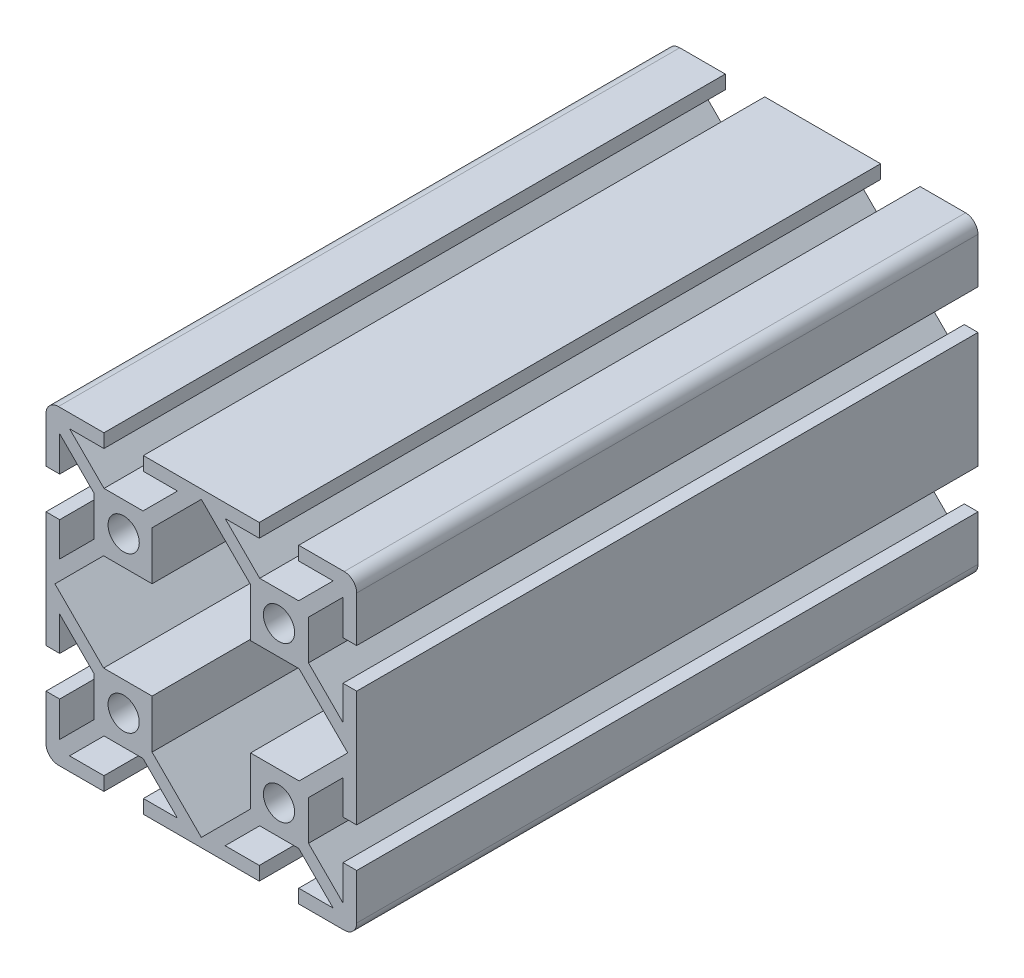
from build123d import *

# Parameters (mm, degrees)
SKETCH1_R      = 2.5527
FINALCUT_DEPTH = 101.6


with BuildPart() as part:
    # Sketch1 → FinalCut (new body)
    with BuildSketch(Plane.XY):
        with BuildLine():
            Line((-17.526, 9.538164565), (-17.526, 16.014235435))
            Line((-17.526, 16.014235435), (-23.1648, 21.653035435))
            Line((-23.1648, 21.653035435), (-23.1648, 15.9258))
            Line((-23.1648, 15.9258), (-25.4, 15.9258))
            Line((-25.4, 15.9258), (-25.4, 23.368))
            ThreePointArc((-25.4, 23.368), (-24.804840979, 24.804840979), (-23.368, 25.4))
            Line((-23.368, 25.4), (-15.9258, 25.4))
            Line((-15.9258, 25.4), (-15.9258, 23.1648))
            Line((-15.9258, 23.1648), (-21.551435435, 23.1648))
            Line((-21.551435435, 23.1648), (-15.912635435, 17.526))
            Line((-15.912635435, 17.526), (-9.538164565, 17.526))
            Line((-9.538164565, 17.526), (-3.899364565, 23.1648))
            Line((-3.899364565, 23.1648), (-9.4742, 23.1648))
            Line((-9.4742, 23.1648), (-9.4742, 25.4))
            Line((-9.4742, 25.4), (9.4742, 25.4))
            Line((9.4742, 25.4), (9.4742, 23.1648))
            Line((9.4742, 23.1648), (3.899364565, 23.1648))
            Line((3.899364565, 23.1648), (9.538164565, 17.526))
            Line((9.538164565, 17.526), (15.912635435, 17.526))
            Line((15.912635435, 17.526), (21.551435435, 23.1648))
            Line((21.551435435, 23.1648), (15.9258, 23.1648))
            Line((15.9258, 23.1648), (15.9258, 25.4))
            Line((15.9258, 25.4), (23.368, 25.4))
            ThreePointArc((23.368, 25.4), (24.804840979, 24.804840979), (25.4, 23.368))
            Line((25.4, 23.368), (25.4, 15.9258))
            Line((25.4, 15.9258), (23.1648, 15.9258))
            Line((23.1648, 15.9258), (23.1648, 21.653035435))
            Line((23.1648, 21.653035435), (17.526, 16.014235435))
            Line((17.526, 16.014235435), (17.526, 9.538164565))
            Line((17.526, 9.538164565), (23.1648, 3.899364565))
            Line((23.1648, 3.899364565), (23.1648, 9.4742))
            Line((23.1648, 9.4742), (25.4, 9.4742))
            Line((25.4, 9.4742), (25.4, -9.4742))
            Line((25.4, -9.4742), (23.1648, -9.4742))
            Line((23.1648, -9.4742), (23.1648, -3.899364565))
            Line((23.1648, -3.899364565), (17.526, -9.538164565))
            Line((17.526, -9.538164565), (17.526, -16.014235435))
            Line((17.526, -16.014235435), (23.1648, -21.653035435))
            Line((23.1648, -21.653035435), (23.1648, -15.9258))
            Line((23.1648, -15.9258), (25.4, -15.9258))
            Line((25.4, -15.9258), (25.4, -23.368))
            ThreePointArc((25.4, -23.368), (24.804840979, -24.804840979), (23.368, -25.4))
            Line((23.368, -25.4), (15.9258, -25.4))
            Line((15.9258, -25.4), (15.9258, -23.1648))
            Line((15.9258, -23.1648), (21.551435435, -23.1648))
            Line((21.551435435, -23.1648), (15.912635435, -17.526))
            Line((15.912635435, -17.526), (9.538164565, -17.526))
            Line((9.538164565, -17.526), (3.899364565, -23.1648))
            Line((3.899364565, -23.1648), (9.4742, -23.1648))
            Line((9.4742, -23.1648), (9.4742, -25.4))
            Line((9.4742, -25.4), (-9.4742, -25.4))
            Line((-9.4742, -25.4), (-9.4742, -23.1648))
            Line((-9.4742, -23.1648), (-3.899364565, -23.1648))
            Line((-3.899364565, -23.1648), (-9.538164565, -17.526))
            Line((-9.538164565, -17.526), (-15.912635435, -17.526))
            Line((-15.912635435, -17.526), (-21.551435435, -23.1648))
            Line((-21.551435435, -23.1648), (-15.9258, -23.1648))
            Line((-15.9258, -23.1648), (-15.9258, -25.4))
            Line((-15.9258, -25.4), (-23.368, -25.4))
            ThreePointArc((-23.368, -25.4), (-24.804840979, -24.804840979), (-25.4, -23.368))
            Line((-25.4, -23.368), (-25.4, -15.9258))
            Line((-25.4, -15.9258), (-23.1648, -15.9258))
            Line((-23.1648, -15.9258), (-23.1648, -21.653035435))
            Line((-23.1648, -21.653035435), (-17.526, -16.014235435))
            Line((-17.526, -16.014235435), (-17.526, -9.538164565))
            Line((-17.526, -9.538164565), (-23.1648, -3.899364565))
            Line((-23.1648, -3.899364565), (-23.1648, -9.4742))
            Line((-23.1648, -9.4742), (-25.4, -9.4742))
            Line((-25.4, -9.4742), (-25.4, 9.4742))
            Line((-25.4, 9.4742), (-23.1648, 9.4742))
            Line((-23.1648, 9.4742), (-23.1648, 3.899364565))
            Line((-23.1648, 3.899364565), (-17.526, 9.538164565))
        make_face()
        with Locations((-12.7, 12.7)):
            Circle(SKETCH1_R, mode=Mode.SUBTRACT)
        with Locations(Location((12.7, 12.7, 0), (0, 0, 180))):
            Circle(SKETCH1_R, mode=Mode.SUBTRACT)
        with Locations((12.7, -12.7)):
            Circle(SKETCH1_R, mode=Mode.SUBTRACT)
        with Locations(Location((-12.7, -12.7, 0), (0, 0, 180))):
            Circle(SKETCH1_R, mode=Mode.SUBTRACT)
        Polygon((-8.0518, 15.887235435), (0, 23.939035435), (8.0518, 15.887235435), (8.0518, 7.9502), (15.988835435, 7.9502), (23.939035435, 0), (15.988835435, -7.9502), (8.0518, -7.9502), (8.0518, -15.887235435), (0, -23.939035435), (-8.0518, -15.887235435), (-8.0518, -7.9502), (-15.988835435, -7.9502), (-23.939035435, 0), (-15.988835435, 7.9502), (-8.0518, 7.9502), align=None, mode=Mode.SUBTRACT)
    extrude(amount=-FINALCUT_DEPTH)


solid = part.part
